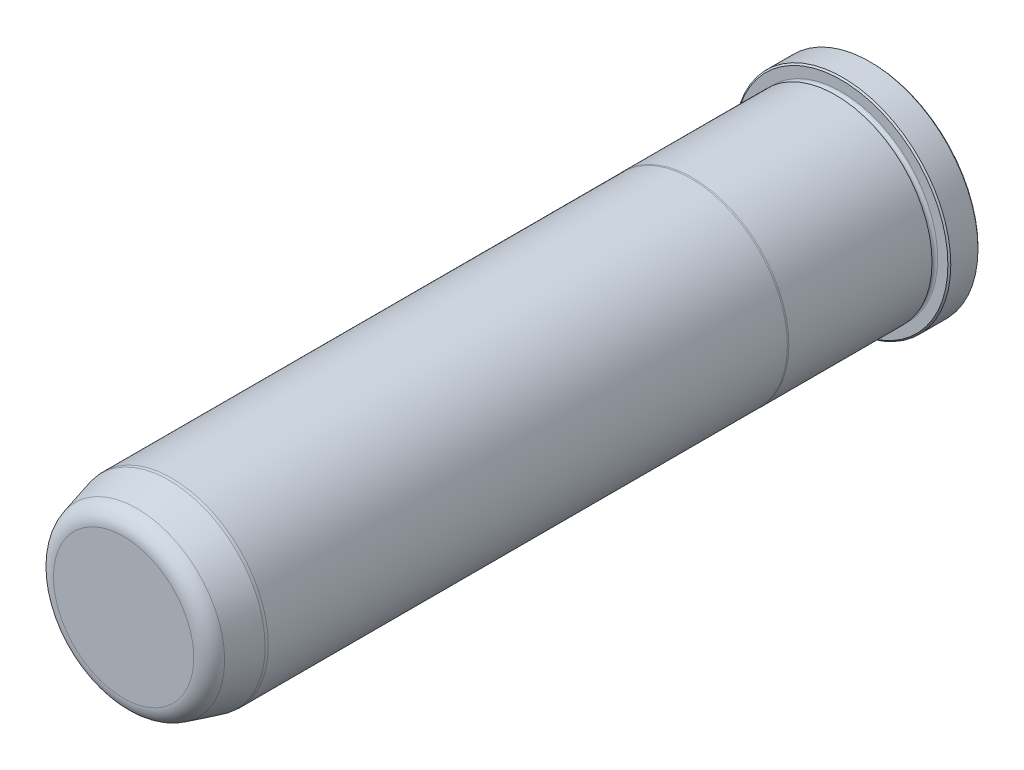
from build123d import *

# Parameters (mm, degrees)
FILLET6_R     = 4.7625
CHAMFER1_SIZE = 0.381


with BuildPart() as part:
    # Sketch1 → Revolve1 (revolve)
    with BuildSketch(Plane(origin=(0, 0, 0), x_dir=(0, 0, -1), z_dir=(1, 0, 0)), mode=Mode.PRIVATE) as revolve1_sk:
        with BuildLine():
            Line((0, 0), (0, 28.448))
            Line((0, 28.448), (-7.9248, 28.448))
            Line((-7.9248, 28.448), (-7.9248, 25.3873))
            ThreePointArc((-7.9248, 25.3873), (-8.6868, 24.6253), (-9.4488, 25.3873))
            Line((-9.4488, 25.3873), (-9.4488, 25.4127))
            Line((-9.4488, 25.4127), (-47.134763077, 25.4127))
            Line((-47.134763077, 25.4127), (-47.498, 25.3873))
            Line((-47.498, 25.3873), (-184.15, 25.3873))
            Line((-184.15, 25.3873), (-184.912, 25.320633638))
            Line((-184.912, 25.320633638), (-196.85, 22.121856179))
            Line((-196.85, 22.121856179), (-196.85, 0))
            Line((-196.85, 0), (0, 0))
        make_face()
    revolve(revolve1_sk.sketch.rotate(Axis((0, 0, 0), (0, 0, -1)), 90), axis=Axis((0, 0, 0), (0, 0, -1)))

    # Fillet6
    fillet6_edges = [part.edges().sort_by_distance(p)[0] for p in [
        (-22.121856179, 0, 196.85),
    ]]
    fillet(fillet6_edges, radius=FILLET6_R)

    # Chamfer1
    chamfer1_edges = [part.edges().sort_by_distance(p)[0] for p in [
        (-28.448, 0, 7.9248),
        (-28.448, 0, 0),
    ]]
    chamfer(chamfer1_edges, length=CHAMFER1_SIZE)


solid = part.part
